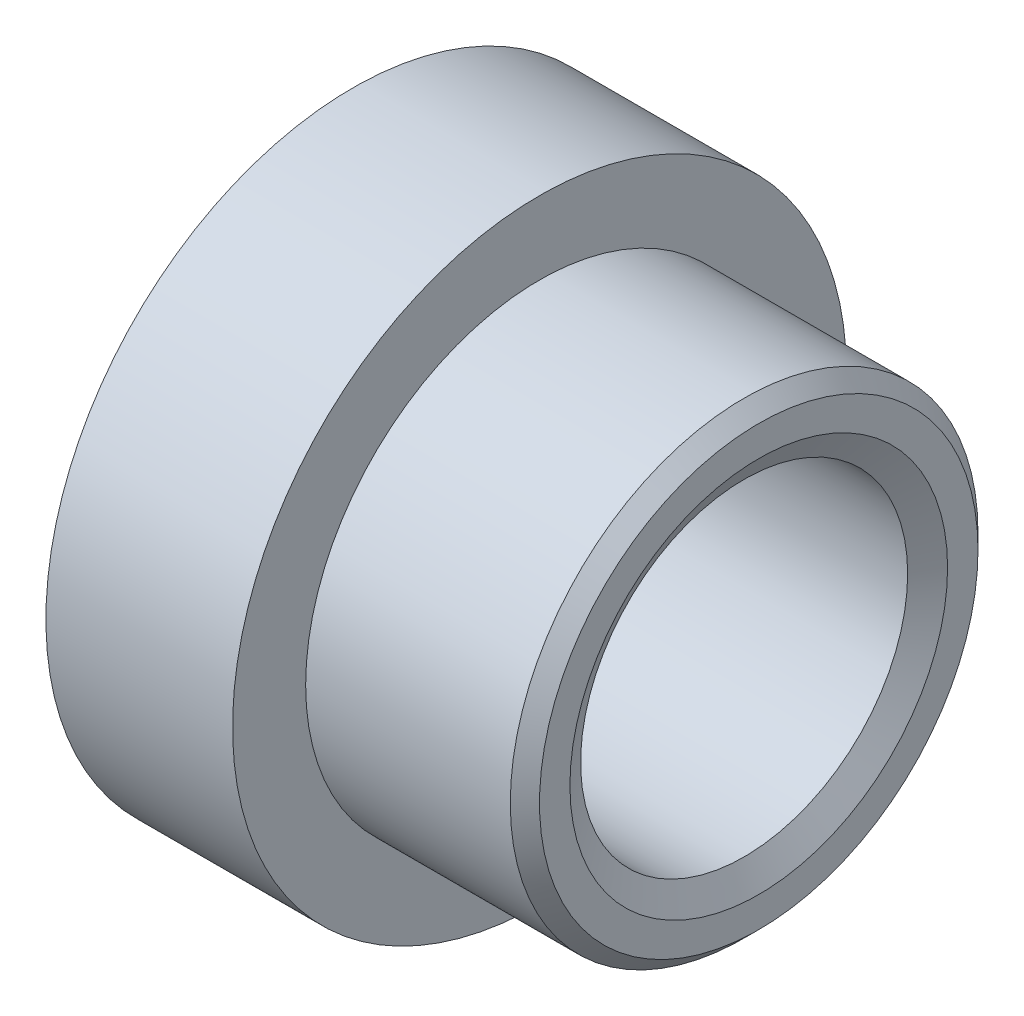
ISO-10303-21;
HEADER;
FILE_DESCRIPTION(('STEP AP214'),'2;1');
FILE_NAME('part.step','',(''),(''),'','','');
FILE_SCHEMA(('AUTOMOTIVE_DESIGN { 1 0 10303 214 1 1 1 1 }'));
ENDSEC;
DATA;
#1=APPLICATION_CONTEXT('core data for automotive mechanical design processes');
#2=APPLICATION_PROTOCOL_DEFINITION('international standard','automotive_design',2000,#1);
#3=PRODUCT_CONTEXT('',#1,'mechanical');
#4=PRODUCT('Part','Part','',(#3));
#5=PRODUCT_RELATED_PRODUCT_CATEGORY('part','',(#4));
#6=PRODUCT_DEFINITION_FORMATION('','',#4);
#7=PRODUCT_DEFINITION_CONTEXT('part definition',#1,'design');
#8=PRODUCT_DEFINITION('design','',#6,#7);
#9=PRODUCT_DEFINITION_SHAPE('','',#8);
#10=(LENGTH_UNIT() NAMED_UNIT(*) SI_UNIT(.MILLI.,.METRE.));
#11=(NAMED_UNIT(*) PLANE_ANGLE_UNIT() SI_UNIT($,.RADIAN.));
#12=(NAMED_UNIT(*) SI_UNIT($,.STERADIAN.) SOLID_ANGLE_UNIT());
#13=UNCERTAINTY_MEASURE_WITH_UNIT(LENGTH_MEASURE(1.E-05),#10,'distance_accuracy_value','');
#14=(GEOMETRIC_REPRESENTATION_CONTEXT(3) GLOBAL_UNCERTAINTY_ASSIGNED_CONTEXT((#13)) GLOBAL_UNIT_ASSIGNED_CONTEXT((#10,
#11,#12)) REPRESENTATION_CONTEXT('',''));
#15=CARTESIAN_POINT('',(0.,0.,0.));
#16=DIRECTION('',(0.,0.,1.));
#17=DIRECTION('',(1.,0.,0.));
#18=AXIS2_PLACEMENT_3D('',#15,#16,#17);
#19=CARTESIAN_POINT('',(-15.,-16.,0.));
#20=DIRECTION('',(-1.,0.,0.));
#21=DIRECTION('',(0.,0.,1.));
#22=AXIS2_PLACEMENT_3D('',#19,#20,#21);
#23=PLANE('',#22);
#24=CARTESIAN_POINT('',(-15.,0.,0.));
#25=DIRECTION('',(1.,0.,0.));
#26=DIRECTION('',(0.,0.,-1.));
#27=AXIS2_PLACEMENT_3D('',#24,#25,#26);
#28=CIRCLE('',#27,16.);
#29=CARTESIAN_POINT('',(-15.,0.,-16.));
#30=VERTEX_POINT('',#29);
#31=EDGE_CURVE('E58',#30,#30,#28,.T.);
#32=ORIENTED_EDGE('',*,*,#31,.F.);
#33=EDGE_LOOP('',(#32));
#34=FACE_BOUND('',#33,.T.);
#35=CARTESIAN_POINT('',(-15.,0.,0.));
#36=DIRECTION('',(1.,0.,0.));
#37=DIRECTION('',(0.,0.,-1.));
#38=AXIS2_PLACEMENT_3D('',#35,#36,#37);
#39=CIRCLE('',#38,21.);
#40=CARTESIAN_POINT('',(-15.,0.,-21.));
#41=VERTEX_POINT('',#40);
#42=EDGE_CURVE('E10',#41,#41,#39,.T.);
#43=ORIENTED_EDGE('',*,*,#42,.T.);
#44=EDGE_LOOP('',(#43));
#45=FACE_BOUND('',#44,.T.);
#46=ADVANCED_FACE('F24',(#34,#45),#23,.F.);
#47=CARTESIAN_POINT('',(0.,0.,0.));
#48=DIRECTION('',(1.,0.,0.));
#49=DIRECTION('',(0.,0.,-1.));
#50=AXIS2_PLACEMENT_3D('',#47,#48,#49);
#51=CYLINDRICAL_SURFACE('',#50,21.);
#52=ORIENTED_EDGE('',*,*,#42,.F.);
#53=EDGE_LOOP('',(#52));
#54=FACE_BOUND('',#53,.T.);
#55=CARTESIAN_POINT('',(-27.7701385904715,0.,0.));
#56=DIRECTION('',(1.,0.,0.));
#57=DIRECTION('',(0.,0.,-1.));
#58=AXIS2_PLACEMENT_3D('',#55,#56,#57);
#59=CIRCLE('',#58,21.);
#60=CARTESIAN_POINT('',(-27.7701385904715,0.,-21.0000000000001));
#61=VERTEX_POINT('',#60);
#62=EDGE_CURVE('E30',#61,#61,#59,.T.);
#63=ORIENTED_EDGE('',*,*,#62,.T.);
#64=EDGE_LOOP('',(#63));
#65=FACE_BOUND('',#64,.T.);
#66=ADVANCED_FACE('F65',(#54,#65),#51,.T.);
#67=CARTESIAN_POINT('',(70.,0.,0.));
#68=DIRECTION('',(1.,0.,0.));
#69=DIRECTION('',(0.,-1.,0.));
#70=AXIS2_PLACEMENT_3D('',#67,#68,#69);
#71=SPHERICAL_SURFACE('',#70,100.);
#72=ORIENTED_EDGE('',*,*,#62,.F.);
#73=EDGE_LOOP('',(#72));
#74=FACE_BOUND('',#73,.T.);
#75=ADVANCED_FACE('F69',(#74),#71,.T.);
#76=CARTESIAN_POINT('',(-23.,-12.5,0.));
#77=DIRECTION('',(-1.,0.,0.));
#78=DIRECTION('',(0.,0.,1.));
#79=AXIS2_PLACEMENT_3D('',#76,#77,#78);
#80=PLANE('',#79);
#81=CARTESIAN_POINT('',(-23.,0.,0.));
#82=DIRECTION('',(1.,0.,0.));
#83=DIRECTION('',(0.,0.,-1.));
#84=AXIS2_PLACEMENT_3D('',#81,#82,#83);
#85=CIRCLE('',#84,12.5);
#86=CARTESIAN_POINT('',(-23.,0.,-12.5));
#87=VERTEX_POINT('',#86);
#88=EDGE_CURVE('E34',#87,#87,#85,.T.);
#89=ORIENTED_EDGE('',*,*,#88,.T.);
#90=EDGE_LOOP('',(#89));
#91=FACE_BOUND('',#90,.T.);
#92=ADVANCED_FACE('F74',(#91),#80,.F.);
#93=CARTESIAN_POINT('',(0.,0.,0.));
#94=DIRECTION('',(1.,0.,0.));
#95=DIRECTION('',(0.,0.,-1.));
#96=AXIS2_PLACEMENT_3D('',#93,#94,#95);
#97=CYLINDRICAL_SURFACE('',#96,12.5);
#98=ORIENTED_EDGE('',*,*,#88,.F.);
#99=EDGE_LOOP('',(#98));
#100=FACE_BOUND('',#99,.T.);
#101=CARTESIAN_POINT('',(-19.,0.,0.));
#102=DIRECTION('',(1.,0.,0.));
#103=DIRECTION('',(0.,0.,-1.));
#104=AXIS2_PLACEMENT_3D('',#101,#102,#103);
#105=CIRCLE('',#104,12.5);
#106=CARTESIAN_POINT('',(-19.,0.,-12.5));
#107=VERTEX_POINT('',#106);
#108=EDGE_CURVE('E38',#107,#107,#105,.T.);
#109=ORIENTED_EDGE('',*,*,#108,.T.);
#110=EDGE_LOOP('',(#109));
#111=FACE_BOUND('',#110,.T.);
#112=ADVANCED_FACE('F80',(#100,#111),#97,.F.);
#113=CARTESIAN_POINT('',(-19.,-11.188,0.));
#114=DIRECTION('',(1.,0.,0.));
#115=DIRECTION('',(0.,0.,-1.));
#116=AXIS2_PLACEMENT_3D('',#113,#114,#115);
#117=PLANE('',#116);
#118=ORIENTED_EDGE('',*,*,#108,.F.);
#119=EDGE_LOOP('',(#118));
#120=FACE_BOUND('',#119,.T.);
#121=CARTESIAN_POINT('',(-19.,0.,0.));
#122=DIRECTION('',(1.,0.,0.));
#123=DIRECTION('',(0.,0.,-1.));
#124=AXIS2_PLACEMENT_3D('',#121,#122,#123);
#125=CIRCLE('',#124,11.188);
#126=CARTESIAN_POINT('',(-19.,0.,-11.188));
#127=VERTEX_POINT('',#126);
#128=EDGE_CURVE('E43',#127,#127,#125,.T.);
#129=ORIENTED_EDGE('',*,*,#128,.T.);
#130=EDGE_LOOP('',(#129));
#131=FACE_BOUND('',#130,.T.);
#132=ADVANCED_FACE('F84',(#120,#131),#117,.F.);
#133=CARTESIAN_POINT('',(0.,0.,0.));
#134=DIRECTION('',(1.,0.,0.));
#135=DIRECTION('',(0.,0.,-1.));
#136=AXIS2_PLACEMENT_3D('',#133,#134,#135);
#137=CYLINDRICAL_SURFACE('',#136,11.188);
#138=ORIENTED_EDGE('',*,*,#128,.F.);
#139=EDGE_LOOP('',(#138));
#140=FACE_BOUND('',#139,.T.);
#141=CARTESIAN_POINT('',(-1.,0.,0.));
#142=DIRECTION('',(1.,0.,0.));
#143=DIRECTION('',(0.,0.,-1.));
#144=AXIS2_PLACEMENT_3D('',#141,#142,#143);
#145=CIRCLE('',#144,11.188);
#146=CARTESIAN_POINT('',(-1.,0.,-11.188));
#147=VERTEX_POINT('',#146);
#148=EDGE_CURVE('E46',#147,#147,#145,.T.);
#149=ORIENTED_EDGE('',*,*,#148,.T.);
#150=EDGE_LOOP('',(#149));
#151=FACE_BOUND('',#150,.T.);
#152=ADVANCED_FACE('F88',(#140,#151),#137,.F.);
#153=CARTESIAN_POINT('',(0.,0.,0.));
#154=DIRECTION('',(1.,0.,0.));
#155=DIRECTION('',(0.,0.,-1.));
#156=AXIS2_PLACEMENT_3D('',#153,#154,#155);
#157=CONICAL_SURFACE('',#156,12.9200508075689,1.04719755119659);
#158=ORIENTED_EDGE('',*,*,#148,.F.);
#159=EDGE_LOOP('',(#158));
#160=FACE_BOUND('',#159,.T.);
#161=CARTESIAN_POINT('',(0.,0.,0.));
#162=DIRECTION('',(1.,0.,0.));
#163=DIRECTION('',(0.,0.,-1.));
#164=AXIS2_PLACEMENT_3D('',#161,#162,#163);
#165=CIRCLE('',#164,12.9200508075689);
#166=CARTESIAN_POINT('',(0.,0.,-12.9200508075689));
#167=VERTEX_POINT('',#166);
#168=EDGE_CURVE('E49',#167,#167,#165,.T.);
#169=ORIENTED_EDGE('',*,*,#168,.T.);
#170=EDGE_LOOP('',(#169));
#171=FACE_BOUND('',#170,.T.);
#172=ADVANCED_FACE('F92',(#160,#171),#157,.F.);
#173=CARTESIAN_POINT('',(0.,-12.9200508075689,0.));
#174=DIRECTION('',(-1.,0.,0.));
#175=DIRECTION('',(0.,0.,1.));
#176=AXIS2_PLACEMENT_3D('',#173,#174,#175);
#177=PLANE('',#176);
#178=ORIENTED_EDGE('',*,*,#168,.F.);
#179=EDGE_LOOP('',(#178));
#180=FACE_BOUND('',#179,.T.);
#181=CARTESIAN_POINT('',(0.,0.,0.));
#182=DIRECTION('',(1.,0.,0.));
#183=DIRECTION('',(0.,0.,-1.));
#184=AXIS2_PLACEMENT_3D('',#181,#182,#183);
#185=CIRCLE('',#184,15.);
#186=CARTESIAN_POINT('',(0.,0.,-15.));
#187=VERTEX_POINT('',#186);
#188=EDGE_CURVE('E52',#187,#187,#185,.T.);
#189=ORIENTED_EDGE('',*,*,#188,.T.);
#190=EDGE_LOOP('',(#189));
#191=FACE_BOUND('',#190,.T.);
#192=ADVANCED_FACE('F96',(#180,#191),#177,.F.);
#193=CARTESIAN_POINT('',(-1.,0.,0.));
#194=DIRECTION('',(-1.,0.,0.));
#195=DIRECTION('',(0.,0.,1.));
#196=AXIS2_PLACEMENT_3D('',#193,#194,#195);
#197=CONICAL_SURFACE('',#196,16.,0.785398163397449);
#198=ORIENTED_EDGE('',*,*,#188,.F.);
#199=EDGE_LOOP('',(#198));
#200=FACE_BOUND('',#199,.T.);
#201=CARTESIAN_POINT('',(-1.,0.,0.));
#202=DIRECTION('',(1.,0.,0.));
#203=DIRECTION('',(0.,0.,-1.));
#204=AXIS2_PLACEMENT_3D('',#201,#202,#203);
#205=CIRCLE('',#204,16.);
#206=CARTESIAN_POINT('',(-1.,0.,-16.));
#207=VERTEX_POINT('',#206);
#208=EDGE_CURVE('E55',#207,#207,#205,.T.);
#209=ORIENTED_EDGE('',*,*,#208,.T.);
#210=EDGE_LOOP('',(#209));
#211=FACE_BOUND('',#210,.T.);
#212=ADVANCED_FACE('F100',(#200,#211),#197,.T.);
#213=CARTESIAN_POINT('',(0.,0.,0.));
#214=DIRECTION('',(1.,0.,0.));
#215=DIRECTION('',(0.,0.,-1.));
#216=AXIS2_PLACEMENT_3D('',#213,#214,#215);
#217=CYLINDRICAL_SURFACE('',#216,16.);
#218=ORIENTED_EDGE('',*,*,#208,.F.);
#219=EDGE_LOOP('',(#218));
#220=FACE_BOUND('',#219,.T.);
#221=ORIENTED_EDGE('',*,*,#31,.T.);
#222=EDGE_LOOP('',(#221));
#223=FACE_BOUND('',#222,.T.);
#224=ADVANCED_FACE('F62',(#220,#223),#217,.T.);
#225=CLOSED_SHELL('',(#46,#66,#75,#92,#112,#132,#152,#172,#192,#212,#224));
#226=MANIFOLD_SOLID_BREP('B2',#225);
#227=ADVANCED_BREP_SHAPE_REPRESENTATION('',(#18,#226),#14);
#228=SHAPE_DEFINITION_REPRESENTATION(#9,#227);
ENDSEC;
END-ISO-10303-21;
